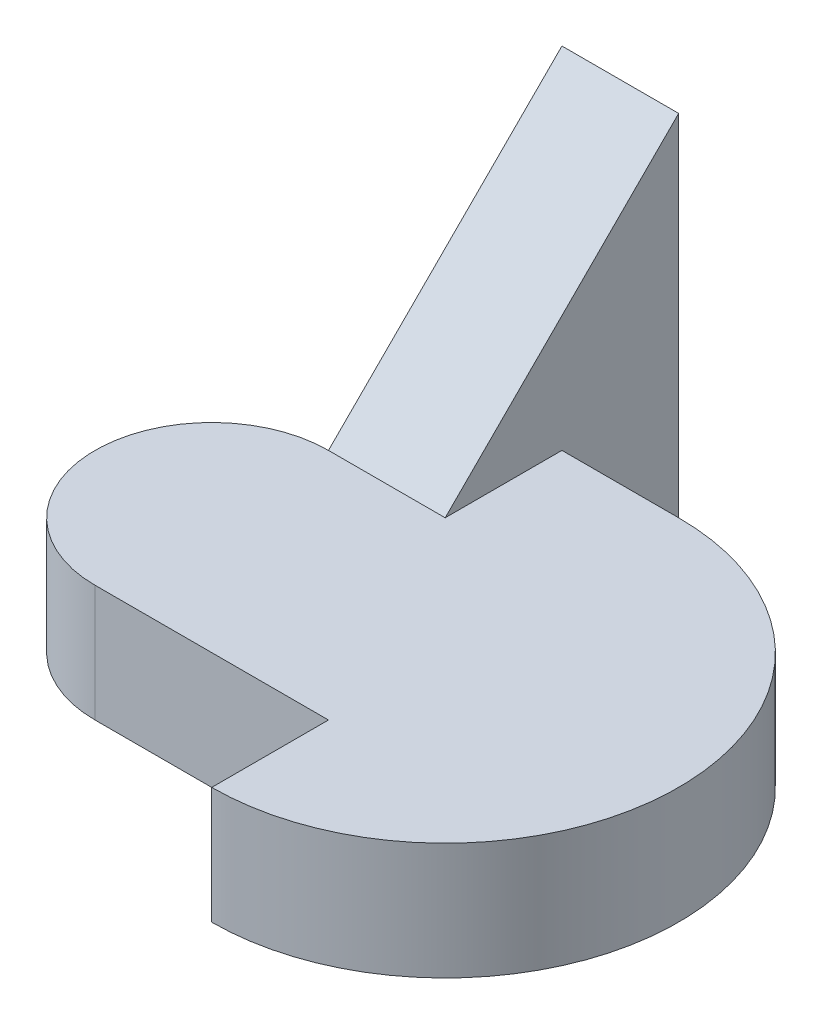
from build123d import *

# Parameters (mm, degrees)
EXTRUDE1_DEPTH = 10
EXTRUDE2_DEPTH = 30
EXTRUDE3_DEPTH = 59.309518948


with BuildPart() as part:
    # Sketch1 → Extrude1 (new body)
    with BuildSketch(Plane(origin=(0, 0, 0), x_dir=(1, 0, 0), z_dir=(0, 1, 0))):
        with BuildLine():
            Line((20, -10), (20, -20))
            ThreePointArc((20, -20), (40, 0), (20, 20))
            Line((20, 20), (10, 20))
            Line((10, 20), (10, 10))
            Line((10, 10), (0, 10))
            ThreePointArc((0, 10), (-10, 0), (0, -10))
            Line((0, -10), (20, -10))
        make_face()
    extrude(amount=EXTRUDE1_DEPTH)

    # Sketch → Extrude2 (add)
    with BuildSketch(Plane(origin=(0, 0, 0), x_dir=(1, 0, 0), z_dir=(0, 1, 0))):
        Polygon((10, 30), (10, 20), (10, 10), (0, 10), (0, 30), align=None)
    extrude(amount=EXTRUDE2_DEPTH)

    # Sketch2 → Extrude3 (cut, through all)
    with BuildSketch(Plane.ZY):
        Polygon((-30, 30), (-10, 10), (-10, 30), align=None)
    extrude(amount=-EXTRUDE3_DEPTH, mode=Mode.SUBTRACT)


solid = part.part
